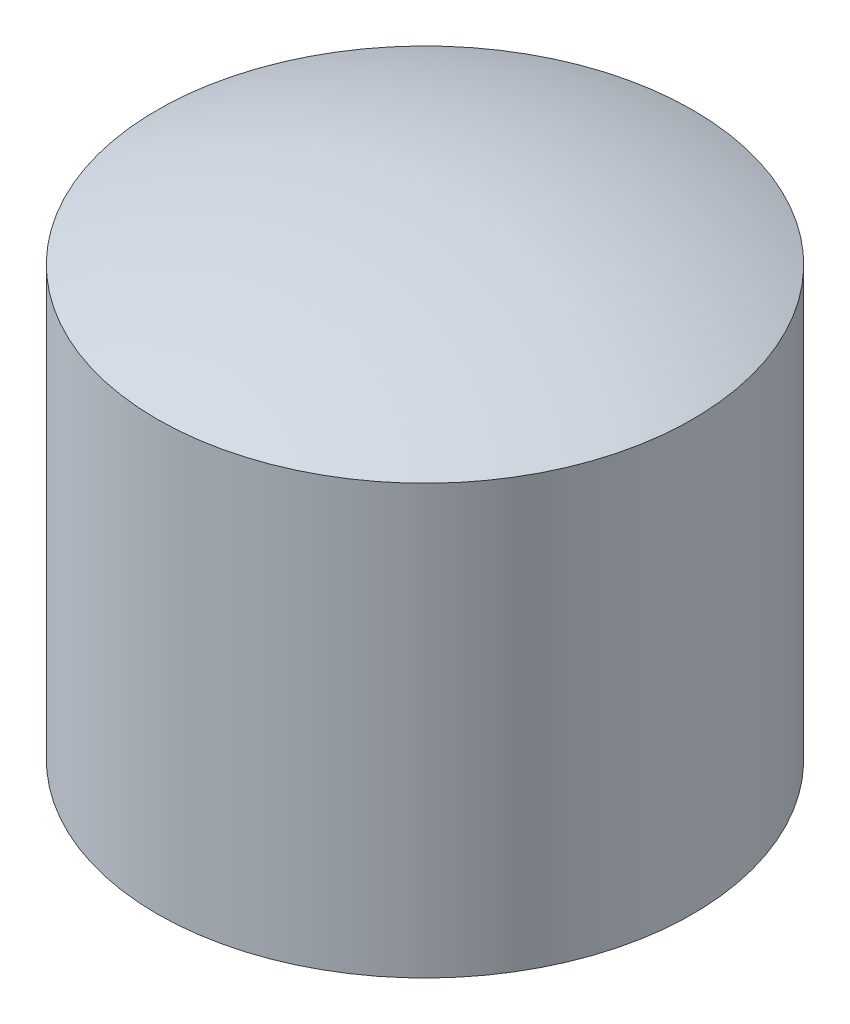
ISO-10303-21;
HEADER;
FILE_DESCRIPTION(('STEP AP214'),'2;1');
FILE_NAME('part.step','',(''),(''),'','','');
FILE_SCHEMA(('AUTOMOTIVE_DESIGN { 1 0 10303 214 1 1 1 1 }'));
ENDSEC;
DATA;
#1=APPLICATION_CONTEXT('core data for automotive mechanical design processes');
#2=APPLICATION_PROTOCOL_DEFINITION('international standard','automotive_design',2000,#1);
#3=PRODUCT_CONTEXT('',#1,'mechanical');
#4=PRODUCT('Part','Part','',(#3));
#5=PRODUCT_RELATED_PRODUCT_CATEGORY('part','',(#4));
#6=PRODUCT_DEFINITION_FORMATION('','',#4);
#7=PRODUCT_DEFINITION_CONTEXT('part definition',#1,'design');
#8=PRODUCT_DEFINITION('design','',#6,#7);
#9=PRODUCT_DEFINITION_SHAPE('','',#8);
#10=(LENGTH_UNIT() NAMED_UNIT(*) SI_UNIT(.MILLI.,.METRE.));
#11=(NAMED_UNIT(*) PLANE_ANGLE_UNIT() SI_UNIT($,.RADIAN.));
#12=(NAMED_UNIT(*) SI_UNIT($,.STERADIAN.) SOLID_ANGLE_UNIT());
#13=UNCERTAINTY_MEASURE_WITH_UNIT(LENGTH_MEASURE(1.E-05),#10,'distance_accuracy_value','');
#14=(GEOMETRIC_REPRESENTATION_CONTEXT(3) GLOBAL_UNCERTAINTY_ASSIGNED_CONTEXT((#13)) GLOBAL_UNIT_ASSIGNED_CONTEXT((#10,
#11,#12)) REPRESENTATION_CONTEXT('',''));
#15=CARTESIAN_POINT('',(0.,0.,0.));
#16=DIRECTION('',(0.,0.,1.));
#17=DIRECTION('',(1.,0.,0.));
#18=AXIS2_PLACEMENT_3D('',#15,#16,#17);
#19=CARTESIAN_POINT('',(0.,8.,0.));
#20=DIRECTION('',(0.,-1.,0.));
#21=DIRECTION('',(0.,0.,-1.));
#22=AXIS2_PLACEMENT_3D('',#19,#20,#21);
#23=CYLINDRICAL_SURFACE('',#22,5.);
#24=CARTESIAN_POINT('',(0.,8.,0.));
#25=DIRECTION('',(0.,1.,0.));
#26=DIRECTION('',(0.,0.,1.));
#27=AXIS2_PLACEMENT_3D('',#24,#25,#26);
#28=CIRCLE('',#27,5.);
#29=CARTESIAN_POINT('',(0.,8.,5.));
#30=VERTEX_POINT('',#29);
#31=EDGE_CURVE('E10',#30,#30,#28,.T.);
#32=ORIENTED_EDGE('',*,*,#31,.F.);
#33=EDGE_LOOP('',(#32));
#34=FACE_BOUND('',#33,.T.);
#35=CARTESIAN_POINT('',(0.,0.,0.));
#36=DIRECTION('',(0.,1.,0.));
#37=DIRECTION('',(0.,0.,1.));
#38=AXIS2_PLACEMENT_3D('',#35,#36,#37);
#39=CIRCLE('',#38,5.);
#40=CARTESIAN_POINT('',(0.,0.,5.));
#41=VERTEX_POINT('',#40);
#42=EDGE_CURVE('E36',#41,#41,#39,.T.);
#43=ORIENTED_EDGE('',*,*,#42,.T.);
#44=EDGE_LOOP('',(#43));
#45=FACE_BOUND('',#44,.T.);
#46=ADVANCED_FACE('F29',(#34,#45),#23,.T.);
#47=CARTESIAN_POINT('',(0.,-3.99999999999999,0.));
#48=DIRECTION('',(0.,0.,1.));
#49=DIRECTION('',(1.,0.,0.));
#50=AXIS2_PLACEMENT_3D('',#47,#48,#49);
#51=SPHERICAL_SURFACE('',#50,13.);
#52=CARTESIAN_POINT('',(0.,-3.99999999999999,0.));
#53=DIRECTION('',(0.,1.,0.));
#54=DIRECTION('',(0.,0.,1.));
#55=AXIS2_PLACEMENT_3D('',#52,#53,#54);
#56=SPHERICAL_SURFACE('',#55,13.);
#57=ORIENTED_EDGE('',*,*,#31,.T.);
#58=EDGE_LOOP('',(#57));
#59=FACE_BOUND('',#58,.T.);
#60=ADVANCED_FACE('F31',(#59),#56,.T.);
#61=CARTESIAN_POINT('',(0.,0.,0.));
#62=DIRECTION('',(0.,1.,0.));
#63=DIRECTION('',(0.,0.,1.));
#64=AXIS2_PLACEMENT_3D('',#61,#62,#63);
#65=PLANE('',#64);
#66=ORIENTED_EDGE('',*,*,#42,.F.);
#67=EDGE_LOOP('',(#66));
#68=FACE_BOUND('',#67,.T.);
#69=ADVANCED_FACE('F43',(#68),#65,.F.);
#70=CLOSED_SHELL('',(#46,#60,#69));
#71=MANIFOLD_SOLID_BREP('B2',#70);
#72=ADVANCED_BREP_SHAPE_REPRESENTATION('',(#18,#71),#14);
#73=SHAPE_DEFINITION_REPRESENTATION(#9,#72);
ENDSEC;
END-ISO-10303-21;
